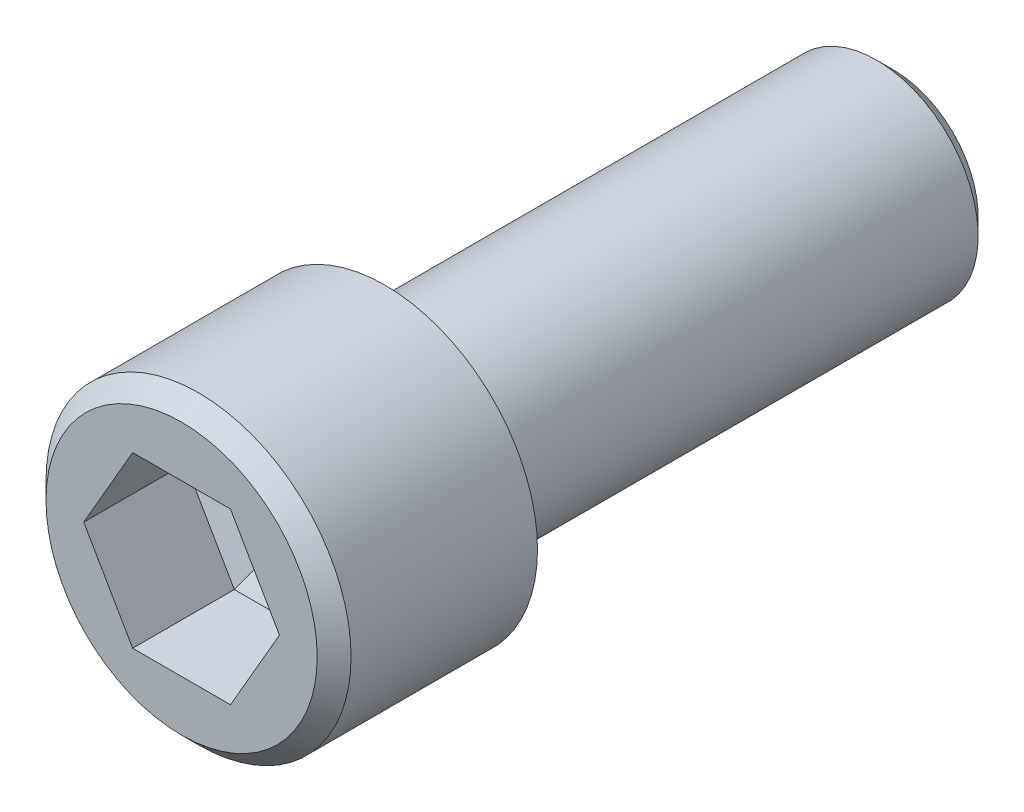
ISO-10303-21;
HEADER;
FILE_DESCRIPTION(('STEP AP214'),'2;1');
FILE_NAME('part.step','',(''),(''),'','','');
FILE_SCHEMA(('AUTOMOTIVE_DESIGN { 1 0 10303 214 1 1 1 1 }'));
ENDSEC;
DATA;
#1=APPLICATION_CONTEXT('core data for automotive mechanical design processes');
#2=APPLICATION_PROTOCOL_DEFINITION('international standard','automotive_design',2000,#1);
#3=PRODUCT_CONTEXT('',#1,'mechanical');
#4=PRODUCT('Part','Part','',(#3));
#5=PRODUCT_RELATED_PRODUCT_CATEGORY('part','',(#4));
#6=PRODUCT_DEFINITION_FORMATION('','',#4);
#7=PRODUCT_DEFINITION_CONTEXT('part definition',#1,'design');
#8=PRODUCT_DEFINITION('design','',#6,#7);
#9=PRODUCT_DEFINITION_SHAPE('','',#8);
#10=(LENGTH_UNIT() NAMED_UNIT(*) SI_UNIT(.MILLI.,.METRE.));
#11=(NAMED_UNIT(*) PLANE_ANGLE_UNIT() SI_UNIT($,.RADIAN.));
#12=(NAMED_UNIT(*) SI_UNIT($,.STERADIAN.) SOLID_ANGLE_UNIT());
#13=UNCERTAINTY_MEASURE_WITH_UNIT(LENGTH_MEASURE(1.E-05),#10,'distance_accuracy_value','');
#14=(GEOMETRIC_REPRESENTATION_CONTEXT(3) GLOBAL_UNCERTAINTY_ASSIGNED_CONTEXT((#13)) GLOBAL_UNIT_ASSIGNED_CONTEXT((#10,
#11,#12)) REPRESENTATION_CONTEXT('',''));
#15=CARTESIAN_POINT('',(0.,0.,0.));
#16=DIRECTION('',(0.,0.,1.));
#17=DIRECTION('',(1.,0.,0.));
#18=AXIS2_PLACEMENT_3D('',#15,#16,#17);
#19=CARTESIAN_POINT('',(-142.,-124.,59.5));
#20=DIRECTION('',(0.,0.,1.));
#21=DIRECTION('',(-1.,0.,0.));
#22=AXIS2_PLACEMENT_3D('',#19,#20,#21);
#23=PLANE('',#22);
#24=DIRECTION('',(0.5,0.866025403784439,0.));
#25=VECTOR('',#24,1.);
#26=CARTESIAN_POINT('',(-139.113248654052,-129.,59.5));
#27=LINE('',#26,#25);
#28=CARTESIAN_POINT('',(-139.113248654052,-129.,59.5));
#29=VERTEX_POINT('',#28);
#30=CARTESIAN_POINT('',(-136.226497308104,-124.,59.5));
#31=VERTEX_POINT('',#30);
#32=EDGE_CURVE('E291',#29,#31,#27,.T.);
#33=ORIENTED_EDGE('',*,*,#32,.F.);
#34=DIRECTION('',(1.,0.,0.));
#35=VECTOR('',#34,1.);
#36=CARTESIAN_POINT('',(-144.886751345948,-129.,59.5));
#37=LINE('',#36,#35);
#38=CARTESIAN_POINT('',(-144.886751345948,-129.,59.5));
#39=VERTEX_POINT('',#38);
#40=EDGE_CURVE('E88',#39,#29,#37,.T.);
#41=ORIENTED_EDGE('',*,*,#40,.F.);
#42=DIRECTION('',(0.5,-0.866025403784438,0.));
#43=VECTOR('',#42,1.);
#44=CARTESIAN_POINT('',(-147.773502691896,-124.,59.5));
#45=LINE('',#44,#43);
#46=CARTESIAN_POINT('',(-147.773502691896,-124.,59.5));
#47=VERTEX_POINT('',#46);
#48=EDGE_CURVE('E31',#47,#39,#45,.T.);
#49=ORIENTED_EDGE('',*,*,#48,.F.);
#50=DIRECTION('',(-0.5,-0.86602540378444,0.));
#51=VECTOR('',#50,1.);
#52=CARTESIAN_POINT('',(-144.886751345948,-119.,59.5));
#53=LINE('',#52,#51);
#54=CARTESIAN_POINT('',(-144.886751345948,-119.,59.5));
#55=VERTEX_POINT('',#54);
#56=EDGE_CURVE('E66',#55,#47,#53,.T.);
#57=ORIENTED_EDGE('',*,*,#56,.F.);
#58=DIRECTION('',(-1.,0.,0.));
#59=VECTOR('',#58,1.);
#60=CARTESIAN_POINT('',(-139.113248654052,-119.,59.5));
#61=LINE('',#60,#59);
#62=CARTESIAN_POINT('',(-139.113248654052,-119.,59.5));
#63=VERTEX_POINT('',#62);
#64=EDGE_CURVE('E76',#63,#55,#61,.T.);
#65=ORIENTED_EDGE('',*,*,#64,.F.);
#66=DIRECTION('',(-0.5,0.866025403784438,0.));
#67=VECTOR('',#66,1.);
#68=CARTESIAN_POINT('',(-136.226497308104,-124.,59.5));
#69=LINE('',#68,#67);
#70=EDGE_CURVE('E82',#31,#63,#69,.T.);
#71=ORIENTED_EDGE('',*,*,#70,.F.);
#72=EDGE_LOOP('',(#33,#41,#49,#57,#65,#71));
#73=FACE_BOUND('',#72,.T.);
#74=CARTESIAN_POINT('',(-142.,-124.,59.5));
#75=DIRECTION('',(0.,0.,1.));
#76=DIRECTION('',(-1.,0.,0.));
#77=AXIS2_PLACEMENT_3D('',#74,#75,#76);
#78=CIRCLE('',#77,8.);
#79=CARTESIAN_POINT('',(-150.,-124.,59.5));
#80=VERTEX_POINT('',#79);
#81=EDGE_CURVE('E110',#80,#80,#78,.T.);
#82=ORIENTED_EDGE('',*,*,#81,.T.);
#83=EDGE_LOOP('',(#82));
#84=FACE_BOUND('',#83,.T.);
#85=ADVANCED_FACE('F16',(#73,#84),#23,.T.);
#86=CARTESIAN_POINT('',(-142.,-124.,47.5));
#87=DIRECTION('',(0.,0.,-1.));
#88=DIRECTION('',(1.,0.,0.));
#89=AXIS2_PLACEMENT_3D('',#86,#87,#88);
#90=PLANE('',#89);
#91=CARTESIAN_POINT('',(-142.,-124.,47.5));
#92=DIRECTION('',(0.,0.,-1.));
#93=DIRECTION('',(-1.,0.,0.));
#94=AXIS2_PLACEMENT_3D('',#91,#92,#93);
#95=CIRCLE('',#94,6.);
#96=CARTESIAN_POINT('',(-148.,-124.,47.5));
#97=VERTEX_POINT('',#96);
#98=EDGE_CURVE('E113',#97,#97,#95,.T.);
#99=ORIENTED_EDGE('',*,*,#98,.F.);
#100=EDGE_LOOP('',(#99));
#101=FACE_BOUND('',#100,.T.);
#102=CARTESIAN_POINT('',(-142.,-124.,47.5));
#103=DIRECTION('',(0.,0.,1.));
#104=DIRECTION('',(-1.,0.,0.));
#105=AXIS2_PLACEMENT_3D('',#102,#103,#104);
#106=CIRCLE('',#105,9.);
#107=CARTESIAN_POINT('',(-151.,-124.,47.5));
#108=VERTEX_POINT('',#107);
#109=EDGE_CURVE('E102',#108,#108,#106,.T.);
#110=ORIENTED_EDGE('',*,*,#109,.F.);
#111=EDGE_LOOP('',(#110));
#112=FACE_BOUND('',#111,.T.);
#113=ADVANCED_FACE('F132',(#101,#112),#90,.T.);
#114=CARTESIAN_POINT('',(-142.,-124.,47.5));
#115=DIRECTION('',(0.,0.,1.));
#116=DIRECTION('',(-1.,0.,0.));
#117=AXIS2_PLACEMENT_3D('',#114,#115,#116);
#118=CYLINDRICAL_SURFACE('',#117,9.);
#119=CARTESIAN_POINT('',(-142.,-124.,58.5));
#120=DIRECTION('',(0.,0.,1.));
#121=DIRECTION('',(-1.,0.,0.));
#122=AXIS2_PLACEMENT_3D('',#119,#120,#121);
#123=CIRCLE('',#122,9.);
#124=CARTESIAN_POINT('',(-151.,-124.,58.5));
#125=VERTEX_POINT('',#124);
#126=EDGE_CURVE('E107',#125,#125,#123,.F.);
#127=ORIENTED_EDGE('',*,*,#126,.T.);
#128=EDGE_LOOP('',(#127));
#129=FACE_BOUND('',#128,.T.);
#130=ORIENTED_EDGE('',*,*,#109,.T.);
#131=EDGE_LOOP('',(#130));
#132=FACE_BOUND('',#131,.T.);
#133=ADVANCED_FACE('F137',(#129,#132),#118,.T.);
#134=CARTESIAN_POINT('',(-142.,-124.,58.5));
#135=DIRECTION('',(0.,0.,-1.));
#136=DIRECTION('',(1.,0.,0.));
#137=AXIS2_PLACEMENT_3D('',#134,#135,#136);
#138=CONICAL_SURFACE('',#137,9.,0.785398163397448);
#139=ORIENTED_EDGE('',*,*,#81,.F.);
#140=EDGE_LOOP('',(#139));
#141=FACE_BOUND('',#140,.T.);
#142=ORIENTED_EDGE('',*,*,#126,.F.);
#143=EDGE_LOOP('',(#142));
#144=FACE_BOUND('',#143,.T.);
#145=ADVANCED_FACE('F143',(#141,#144),#138,.T.);
#146=CARTESIAN_POINT('',(-139.113248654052,-129.,53.5));
#147=DIRECTION('',(0.866025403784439,-0.5,0.));
#148=DIRECTION('',(-0.5,-0.866025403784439,0.));
#149=AXIS2_PLACEMENT_3D('',#146,#147,#148);
#150=PLANE('',#149);
#151=ORIENTED_EDGE('',*,*,#32,.T.);
#152=DIRECTION('',(0.,0.,1.));
#153=VECTOR('',#152,1.);
#154=CARTESIAN_POINT('',(-136.226497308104,-124.,53.5));
#155=LINE('',#154,#153);
#156=CARTESIAN_POINT('',(-136.226497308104,-124.,53.5));
#157=VERTEX_POINT('',#156);
#158=EDGE_CURVE('E100',#157,#31,#155,.T.);
#159=ORIENTED_EDGE('',*,*,#158,.F.);
#160=DIRECTION('',(0.5,0.866025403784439,0.));
#161=VECTOR('',#160,1.);
#162=CARTESIAN_POINT('',(-139.113248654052,-129.,53.5));
#163=LINE('',#162,#161);
#164=CARTESIAN_POINT('',(-139.113248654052,-129.,53.5));
#165=VERTEX_POINT('',#164);
#166=EDGE_CURVE('E94',#165,#157,#163,.T.);
#167=ORIENTED_EDGE('',*,*,#166,.F.);
#168=DIRECTION('',(0.,0.,1.));
#169=VECTOR('',#168,1.);
#170=CARTESIAN_POINT('',(-139.113248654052,-129.,53.5));
#171=LINE('',#170,#169);
#172=EDGE_CURVE('E97',#165,#29,#171,.T.);
#173=ORIENTED_EDGE('',*,*,#172,.T.);
#174=EDGE_LOOP('',(#151,#159,#167,#173));
#175=FACE_BOUND('',#174,.T.);
#176=ADVANCED_FACE('F146',(#175),#150,.F.);
#177=CARTESIAN_POINT('',(-136.226497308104,-124.,53.5));
#178=DIRECTION('',(0.866025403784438,0.5,0.));
#179=DIRECTION('',(0.5,-0.866025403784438,0.));
#180=AXIS2_PLACEMENT_3D('',#177,#178,#179);
#181=PLANE('',#180);
#182=ORIENTED_EDGE('',*,*,#70,.T.);
#183=DIRECTION('',(0.,0.,1.));
#184=VECTOR('',#183,1.);
#185=CARTESIAN_POINT('',(-139.113248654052,-119.,53.5));
#186=LINE('',#185,#184);
#187=CARTESIAN_POINT('',(-139.113248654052,-119.,53.5));
#188=VERTEX_POINT('',#187);
#189=EDGE_CURVE('E72',#188,#63,#186,.T.);
#190=ORIENTED_EDGE('',*,*,#189,.F.);
#191=DIRECTION('',(-0.5,0.866025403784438,0.));
#192=VECTOR('',#191,1.);
#193=CARTESIAN_POINT('',(-136.226497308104,-124.,53.5));
#194=LINE('',#193,#192);
#195=EDGE_CURVE('E288',#157,#188,#194,.T.);
#196=ORIENTED_EDGE('',*,*,#195,.F.);
#197=ORIENTED_EDGE('',*,*,#158,.T.);
#198=EDGE_LOOP('',(#182,#190,#196,#197));
#199=FACE_BOUND('',#198,.T.);
#200=ADVANCED_FACE('F151',(#199),#181,.F.);
#201=CARTESIAN_POINT('',(-139.113248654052,-119.,53.5));
#202=DIRECTION('',(0.,1.,0.));
#203=DIRECTION('',(1.,0.,0.));
#204=AXIS2_PLACEMENT_3D('',#201,#202,#203);
#205=PLANE('',#204);
#206=ORIENTED_EDGE('',*,*,#64,.T.);
#207=DIRECTION('',(0.,0.,1.));
#208=VECTOR('',#207,1.);
#209=CARTESIAN_POINT('',(-144.886751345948,-119.,53.5));
#210=LINE('',#209,#208);
#211=CARTESIAN_POINT('',(-144.886751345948,-119.,53.5));
#212=VERTEX_POINT('',#211);
#213=EDGE_CURVE('E61',#212,#55,#210,.T.);
#214=ORIENTED_EDGE('',*,*,#213,.F.);
#215=DIRECTION('',(-1.,0.,0.));
#216=VECTOR('',#215,1.);
#217=CARTESIAN_POINT('',(-139.113248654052,-119.,53.5));
#218=LINE('',#217,#216);
#219=EDGE_CURVE('E294',#188,#212,#218,.T.);
#220=ORIENTED_EDGE('',*,*,#219,.F.);
#221=ORIENTED_EDGE('',*,*,#189,.T.);
#222=EDGE_LOOP('',(#206,#214,#220,#221));
#223=FACE_BOUND('',#222,.T.);
#224=ADVANCED_FACE('F77',(#223),#205,.F.);
#225=CARTESIAN_POINT('',(-144.886751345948,-119.,53.5));
#226=DIRECTION('',(-0.86602540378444,0.5,0.));
#227=DIRECTION('',(0.5,0.86602540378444,0.));
#228=AXIS2_PLACEMENT_3D('',#225,#226,#227);
#229=PLANE('',#228);
#230=ORIENTED_EDGE('',*,*,#56,.T.);
#231=DIRECTION('',(0.,0.,1.));
#232=VECTOR('',#231,1.);
#233=CARTESIAN_POINT('',(-147.773502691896,-124.,53.5));
#234=LINE('',#233,#232);
#235=CARTESIAN_POINT('',(-147.773502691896,-124.,53.5));
#236=VERTEX_POINT('',#235);
#237=EDGE_CURVE('E73',#236,#47,#234,.T.);
#238=ORIENTED_EDGE('',*,*,#237,.F.);
#239=DIRECTION('',(-0.5,-0.86602540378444,0.));
#240=VECTOR('',#239,1.);
#241=CARTESIAN_POINT('',(-144.886751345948,-119.,53.5));
#242=LINE('',#241,#240);
#243=EDGE_CURVE('E69',#212,#236,#242,.T.);
#244=ORIENTED_EDGE('',*,*,#243,.F.);
#245=ORIENTED_EDGE('',*,*,#213,.T.);
#246=EDGE_LOOP('',(#230,#238,#244,#245));
#247=FACE_BOUND('',#246,.T.);
#248=ADVANCED_FACE('F63',(#247),#229,.F.);
#249=CARTESIAN_POINT('',(-147.773502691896,-124.,53.5));
#250=DIRECTION('',(-0.866025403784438,-0.5,0.));
#251=DIRECTION('',(-0.5,0.866025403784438,0.));
#252=AXIS2_PLACEMENT_3D('',#249,#250,#251);
#253=PLANE('',#252);
#254=ORIENTED_EDGE('',*,*,#48,.T.);
#255=DIRECTION('',(0.,0.,1.));
#256=VECTOR('',#255,1.);
#257=CARTESIAN_POINT('',(-144.886751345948,-129.,53.5));
#258=LINE('',#257,#256);
#259=CARTESIAN_POINT('',(-144.886751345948,-129.,53.5));
#260=VERTEX_POINT('',#259);
#261=EDGE_CURVE('E95',#260,#39,#258,.T.);
#262=ORIENTED_EDGE('',*,*,#261,.F.);
#263=DIRECTION('',(0.5,-0.866025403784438,0.));
#264=VECTOR('',#263,1.);
#265=CARTESIAN_POINT('',(-147.773502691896,-124.,53.5));
#266=LINE('',#265,#264);
#267=EDGE_CURVE('E40',#236,#260,#266,.T.);
#268=ORIENTED_EDGE('',*,*,#267,.F.);
#269=ORIENTED_EDGE('',*,*,#237,.T.);
#270=EDGE_LOOP('',(#254,#262,#268,#269));
#271=FACE_BOUND('',#270,.T.);
#272=ADVANCED_FACE('F170',(#271),#253,.F.);
#273=CARTESIAN_POINT('',(-144.886751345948,-129.,53.5));
#274=DIRECTION('',(0.,-1.,0.));
#275=DIRECTION('',(-1.,0.,0.));
#276=AXIS2_PLACEMENT_3D('',#273,#274,#275);
#277=PLANE('',#276);
#278=ORIENTED_EDGE('',*,*,#40,.T.);
#279=ORIENTED_EDGE('',*,*,#172,.F.);
#280=DIRECTION('',(1.,0.,0.));
#281=VECTOR('',#280,1.);
#282=CARTESIAN_POINT('',(-144.886751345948,-129.,53.5));
#283=LINE('',#282,#281);
#284=EDGE_CURVE('E104',#260,#165,#283,.T.);
#285=ORIENTED_EDGE('',*,*,#284,.F.);
#286=ORIENTED_EDGE('',*,*,#261,.T.);
#287=EDGE_LOOP('',(#278,#279,#285,#286));
#288=FACE_BOUND('',#287,.T.);
#289=ADVANCED_FACE('F173',(#288),#277,.F.);
#290=CARTESIAN_POINT('',(-139.113248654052,-129.,53.5));
#291=DIRECTION('',(0.43301270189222,-0.25,-0.866025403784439));
#292=DIRECTION('',(0.894427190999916,0.,0.447213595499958));
#293=AXIS2_PLACEMENT_3D('',#290,#291,#292);
#294=PLANE('',#293);
#295=ORIENTED_EDGE('',*,*,#166,.T.);
#296=DIRECTION('',(0.894427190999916,0.,0.447213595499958));
#297=VECTOR('',#296,1.);
#298=CARTESIAN_POINT('',(-138.535898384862,-124.,52.345299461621));
#299=LINE('',#298,#297);
#300=CARTESIAN_POINT('',(-142.,-124.,50.6132486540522));
#301=VERTEX_POINT('',#300);
#302=EDGE_CURVE('E281',#301,#157,#299,.T.);
#303=ORIENTED_EDGE('',*,*,#302,.F.);
#304=DIRECTION('',(0.447213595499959,-0.774596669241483,0.447213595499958));
#305=VECTOR('',#304,1.);
#306=CARTESIAN_POINT('',(-140.267949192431,-127.,52.345299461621));
#307=LINE('',#306,#305);
#308=EDGE_CURVE('E284',#301,#165,#307,.T.);
#309=ORIENTED_EDGE('',*,*,#308,.T.);
#310=EDGE_LOOP('',(#295,#303,#309));
#311=FACE_BOUND('',#310,.T.);
#312=ADVANCED_FACE('F176',(#311),#294,.F.);
#313=CARTESIAN_POINT('',(-136.226497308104,-124.,53.5));
#314=DIRECTION('',(0.433012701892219,0.25,-0.866025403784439));
#315=DIRECTION('',(0.894427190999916,0.,0.447213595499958));
#316=AXIS2_PLACEMENT_3D('',#313,#314,#315);
#317=PLANE('',#316);
#318=ORIENTED_EDGE('',*,*,#195,.T.);
#319=DIRECTION('',(0.447213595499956,0.774596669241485,0.447213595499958));
#320=VECTOR('',#319,1.);
#321=CARTESIAN_POINT('',(-140.267949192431,-121.,52.345299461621));
#322=LINE('',#321,#320);
#323=EDGE_CURVE('E314',#301,#188,#322,.T.);
#324=ORIENTED_EDGE('',*,*,#323,.F.);
#325=ORIENTED_EDGE('',*,*,#302,.T.);
#326=EDGE_LOOP('',(#318,#324,#325));
#327=FACE_BOUND('',#326,.T.);
#328=ADVANCED_FACE('F192',(#327),#317,.F.);
#329=CARTESIAN_POINT('',(-139.113248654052,-119.,53.5));
#330=DIRECTION('',(0.,0.5,-0.866025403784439));
#331=DIRECTION('',(0.,0.866025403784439,0.5));
#332=AXIS2_PLACEMENT_3D('',#329,#330,#331);
#333=PLANE('',#332);
#334=ORIENTED_EDGE('',*,*,#219,.T.);
#335=DIRECTION('',(-0.447213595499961,0.774596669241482,0.447213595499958));
#336=VECTOR('',#335,1.);
#337=CARTESIAN_POINT('',(-143.732050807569,-121.,52.345299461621));
#338=LINE('',#337,#336);
#339=EDGE_CURVE('E315',#301,#212,#338,.T.);
#340=ORIENTED_EDGE('',*,*,#339,.F.);
#341=ORIENTED_EDGE('',*,*,#323,.T.);
#342=EDGE_LOOP('',(#334,#340,#341));
#343=FACE_BOUND('',#342,.T.);
#344=ADVANCED_FACE('F188',(#343),#333,.F.);
#345=CARTESIAN_POINT('',(-144.886751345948,-119.,53.5));
#346=DIRECTION('',(-0.43301270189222,0.25,-0.866025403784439));
#347=DIRECTION('',(0.894427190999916,0.,-0.447213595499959));
#348=AXIS2_PLACEMENT_3D('',#345,#346,#347);
#349=PLANE('',#348);
#350=ORIENTED_EDGE('',*,*,#243,.T.);
#351=DIRECTION('',(-0.894427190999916,0.,0.447213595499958));
#352=VECTOR('',#351,1.);
#353=CARTESIAN_POINT('',(-145.464101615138,-124.,52.345299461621));
#354=LINE('',#353,#352);
#355=EDGE_CURVE('E308',#301,#236,#354,.T.);
#356=ORIENTED_EDGE('',*,*,#355,.F.);
#357=ORIENTED_EDGE('',*,*,#339,.T.);
#358=EDGE_LOOP('',(#350,#356,#357));
#359=FACE_BOUND('',#358,.T.);
#360=ADVANCED_FACE('F185',(#359),#349,.F.);
#361=CARTESIAN_POINT('',(-147.773502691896,-124.,53.5));
#362=DIRECTION('',(-0.433012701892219,-0.25,-0.866025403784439));
#363=DIRECTION('',(0.894427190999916,0.,-0.447213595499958));
#364=AXIS2_PLACEMENT_3D('',#361,#362,#363);
#365=PLANE('',#364);
#366=ORIENTED_EDGE('',*,*,#267,.T.);
#367=DIRECTION('',(-0.447213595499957,-0.774596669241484,0.447213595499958));
#368=VECTOR('',#367,1.);
#369=CARTESIAN_POINT('',(-143.732050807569,-127.,52.345299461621));
#370=LINE('',#369,#368);
#371=EDGE_CURVE('E321',#301,#260,#370,.T.);
#372=ORIENTED_EDGE('',*,*,#371,.F.);
#373=ORIENTED_EDGE('',*,*,#355,.T.);
#374=EDGE_LOOP('',(#366,#372,#373));
#375=FACE_BOUND('',#374,.T.);
#376=ADVANCED_FACE('F181',(#375),#365,.F.);
#377=CARTESIAN_POINT('',(-144.886751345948,-129.,53.5));
#378=DIRECTION('',(0.,-0.5,-0.866025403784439));
#379=DIRECTION('',(0.,0.866025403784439,-0.5));
#380=AXIS2_PLACEMENT_3D('',#377,#378,#379);
#381=PLANE('',#380);
#382=ORIENTED_EDGE('',*,*,#284,.T.);
#383=ORIENTED_EDGE('',*,*,#308,.F.);
#384=ORIENTED_EDGE('',*,*,#371,.T.);
#385=EDGE_LOOP('',(#382,#383,#384));
#386=FACE_BOUND('',#385,.T.);
#387=ADVANCED_FACE('F178',(#386),#381,.F.);
#388=CARTESIAN_POINT('',(-142.,-124.,17.5000000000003));
#389=DIRECTION('',(0.,0.,1.));
#390=DIRECTION('',(1.,0.,0.));
#391=AXIS2_PLACEMENT_3D('',#388,#389,#390);
#392=CYLINDRICAL_SURFACE('',#391,6.);
#393=CARTESIAN_POINT('',(-142.,-124.,18.5000000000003));
#394=DIRECTION('',(0.,0.,-1.));
#395=DIRECTION('',(-1.,0.,0.));
#396=AXIS2_PLACEMENT_3D('',#393,#394,#395);
#397=CIRCLE('',#396,6.);
#398=CARTESIAN_POINT('',(-148.,-124.,18.5000000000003));
#399=VERTEX_POINT('',#398);
#400=EDGE_CURVE('E24',#399,#399,#397,.F.);
#401=ORIENTED_EDGE('',*,*,#400,.T.);
#402=EDGE_LOOP('',(#401));
#403=FACE_BOUND('',#402,.T.);
#404=ORIENTED_EDGE('',*,*,#98,.T.);
#405=EDGE_LOOP('',(#404));
#406=FACE_BOUND('',#405,.T.);
#407=ADVANCED_FACE('F118',(#403,#406),#392,.T.);
#408=CARTESIAN_POINT('',(-142.,-124.,17.5000000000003));
#409=DIRECTION('',(0.,0.,-1.));
#410=DIRECTION('',(1.,0.,0.));
#411=AXIS2_PLACEMENT_3D('',#408,#409,#410);
#412=PLANE('',#411);
#413=CARTESIAN_POINT('',(-142.,-124.,17.5000000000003));
#414=DIRECTION('',(0.,0.,-1.));
#415=DIRECTION('',(-1.,0.,0.));
#416=AXIS2_PLACEMENT_3D('',#413,#414,#415);
#417=CIRCLE('',#416,5.);
#418=CARTESIAN_POINT('',(-147.,-124.,17.5000000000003));
#419=VERTEX_POINT('',#418);
#420=EDGE_CURVE('E11',#419,#419,#417,.T.);
#421=ORIENTED_EDGE('',*,*,#420,.T.);
#422=EDGE_LOOP('',(#421));
#423=FACE_BOUND('',#422,.T.);
#424=ADVANCED_FACE('F122',(#423),#412,.T.);
#425=CARTESIAN_POINT('',(-142.,-124.,18.5000000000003));
#426=DIRECTION('',(0.,0.,1.));
#427=DIRECTION('',(1.,0.,0.));
#428=AXIS2_PLACEMENT_3D('',#425,#426,#427);
#429=CONICAL_SURFACE('',#428,6.,0.785398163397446);
#430=ORIENTED_EDGE('',*,*,#420,.F.);
#431=EDGE_LOOP('',(#430));
#432=FACE_BOUND('',#431,.T.);
#433=ORIENTED_EDGE('',*,*,#400,.F.);
#434=EDGE_LOOP('',(#433));
#435=FACE_BOUND('',#434,.T.);
#436=ADVANCED_FACE('F18',(#432,#435),#429,.T.);
#437=CLOSED_SHELL('',(#85,#113,#133,#145,#176,#200,#224,#248,#272,#289,#312,#328,#344,#360,#376,
#387,#407,#424,#436));
#438=MANIFOLD_SOLID_BREP('B1',#437);
#439=ADVANCED_BREP_SHAPE_REPRESENTATION('',(#18,#438),#14);
#440=SHAPE_DEFINITION_REPRESENTATION(#9,#439);
ENDSEC;
END-ISO-10303-21;
